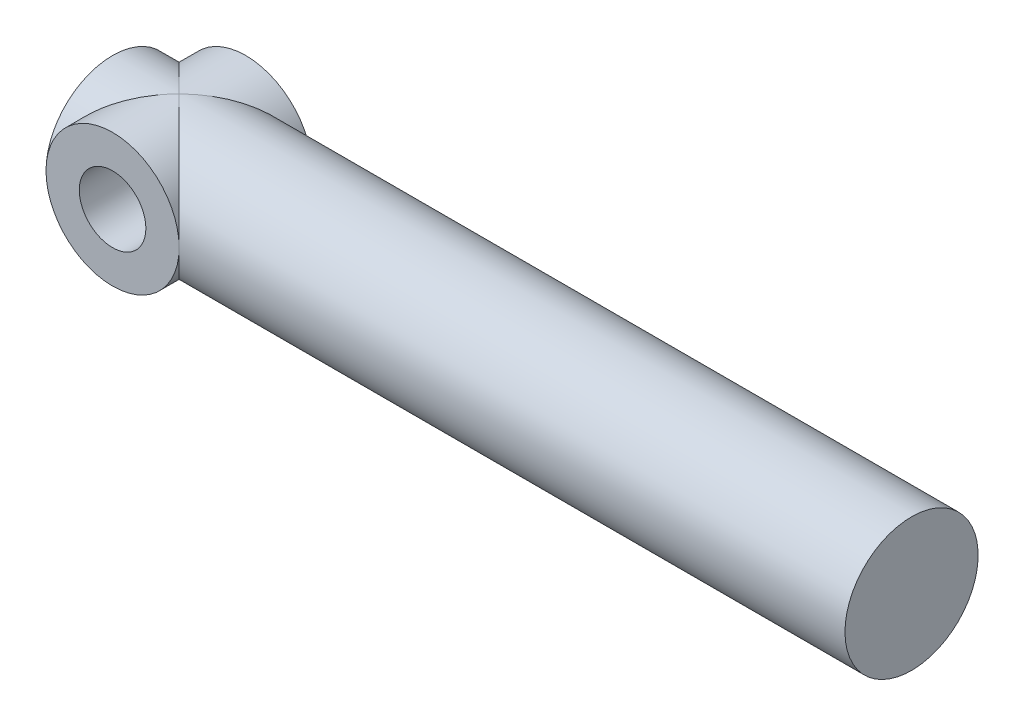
ISO-10303-21;
HEADER;
FILE_DESCRIPTION(('STEP AP214'),'2;1');
FILE_NAME('part.step','',(''),(''),'','','');
FILE_SCHEMA(('AUTOMOTIVE_DESIGN { 1 0 10303 214 1 1 1 1 }'));
ENDSEC;
DATA;
#1=APPLICATION_CONTEXT('core data for automotive mechanical design processes');
#2=APPLICATION_PROTOCOL_DEFINITION('international standard','automotive_design',2000,#1);
#3=PRODUCT_CONTEXT('',#1,'mechanical');
#4=PRODUCT('Part','Part','',(#3));
#5=PRODUCT_RELATED_PRODUCT_CATEGORY('part','',(#4));
#6=PRODUCT_DEFINITION_FORMATION('','',#4);
#7=PRODUCT_DEFINITION_CONTEXT('part definition',#1,'design');
#8=PRODUCT_DEFINITION('design','',#6,#7);
#9=PRODUCT_DEFINITION_SHAPE('','',#8);
#10=(LENGTH_UNIT() NAMED_UNIT(*) SI_UNIT(.MILLI.,.METRE.));
#11=(NAMED_UNIT(*) PLANE_ANGLE_UNIT() SI_UNIT($,.RADIAN.));
#12=(NAMED_UNIT(*) SI_UNIT($,.STERADIAN.) SOLID_ANGLE_UNIT());
#13=UNCERTAINTY_MEASURE_WITH_UNIT(LENGTH_MEASURE(1.E-05),#10,'distance_accuracy_value','');
#14=(GEOMETRIC_REPRESENTATION_CONTEXT(3) GLOBAL_UNCERTAINTY_ASSIGNED_CONTEXT((#13)) GLOBAL_UNIT_ASSIGNED_CONTEXT((#10,
#11,#12)) REPRESENTATION_CONTEXT('',''));
#15=CARTESIAN_POINT('',(0.,0.,0.));
#16=DIRECTION('',(0.,0.,1.));
#17=DIRECTION('',(1.,0.,0.));
#18=AXIS2_PLACEMENT_3D('',#15,#16,#17);
#19=CARTESIAN_POINT('',(0.,0.,0.));
#20=DIRECTION('',(-1.,0.,0.));
#21=DIRECTION('',(0.,0.,1.));
#22=AXIS2_PLACEMENT_3D('',#19,#20,#21);
#23=CYLINDRICAL_SURFACE('',#22,3.175);
#24=CARTESIAN_POINT('',(38.1,0.,0.));
#25=DIRECTION('',(-1.,0.,0.));
#26=DIRECTION('',(0.,0.,1.));
#27=AXIS2_PLACEMENT_3D('',#24,#25,#26);
#28=CIRCLE('',#27,3.175);
#29=CARTESIAN_POINT('',(38.1,0.,3.175));
#30=VERTEX_POINT('',#29);
#31=EDGE_CURVE('E80',#30,#30,#28,.T.);
#32=ORIENTED_EDGE('',*,*,#31,.T.);
#33=EDGE_LOOP('',(#32));
#34=FACE_BOUND('',#33,.T.);
#35=CARTESIAN_POINT('',(3.175,0.,0.));
#36=DIRECTION('',(-0.707106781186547,0.,-0.707106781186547));
#37=DIRECTION('',(-0.707106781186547,0.,0.707106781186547));
#38=AXIS2_PLACEMENT_3D('',#35,#36,#37);
#39=ELLIPSE('',#38,4.49012806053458,3.175);
#40=CARTESIAN_POINT('',(3.175,3.175,0.));
#41=VERTEX_POINT('',#40);
#42=CARTESIAN_POINT('',(6.35,0.,-3.175));
#43=VERTEX_POINT('',#42);
#44=EDGE_CURVE('E76',#41,#43,#39,.T.);
#45=ORIENTED_EDGE('',*,*,#44,.F.);
#46=CARTESIAN_POINT('',(3.175,0.,0.));
#47=DIRECTION('',(-0.707106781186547,0.,0.707106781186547));
#48=DIRECTION('',(-0.707106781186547,0.,-0.707106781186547));
#49=AXIS2_PLACEMENT_3D('',#46,#47,#48);
#50=ELLIPSE('',#49,4.49012806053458,3.175);
#51=CARTESIAN_POINT('',(6.35,0.,3.175));
#52=VERTEX_POINT('',#51);
#53=EDGE_CURVE('E90',#52,#41,#50,.T.);
#54=ORIENTED_EDGE('',*,*,#53,.F.);
#55=CARTESIAN_POINT('',(3.175,-3.175,0.));
#56=VERTEX_POINT('',#55);
#57=EDGE_CURVE('E94',#56,#52,#50,.T.);
#58=ORIENTED_EDGE('',*,*,#57,.F.);
#59=EDGE_CURVE('E53',#43,#56,#39,.T.);
#60=ORIENTED_EDGE('',*,*,#59,.F.);
#61=EDGE_LOOP('',(#45,#54,#58,#60));
#62=FACE_BOUND('',#61,.T.);
#63=ADVANCED_FACE('F30',(#34,#62),#23,.T.);
#64=CARTESIAN_POINT('',(38.1,3.175,0.));
#65=DIRECTION('',(-1.,0.,0.));
#66=DIRECTION('',(0.,0.,1.));
#67=AXIS2_PLACEMENT_3D('',#64,#65,#66);
#68=PLANE('',#67);
#69=ORIENTED_EDGE('',*,*,#31,.F.);
#70=EDGE_LOOP('',(#69));
#71=FACE_BOUND('',#70,.T.);
#72=ADVANCED_FACE('F120',(#71),#68,.F.);
#73=CARTESIAN_POINT('',(3.175,0.,3.17500000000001));
#74=DIRECTION('',(0.,0.,-1.));
#75=DIRECTION('',(-1.,0.,0.));
#76=AXIS2_PLACEMENT_3D('',#73,#74,#75);
#77=CYLINDRICAL_SURFACE('',#76,3.175);
#78=ORIENTED_EDGE('',*,*,#59,.T.);
#79=CARTESIAN_POINT('',(3.175,0.,0.));
#80=DIRECTION('',(-0.707106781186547,0.,0.707106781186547));
#81=DIRECTION('',(-0.707106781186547,0.,-0.707106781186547));
#82=AXIS2_PLACEMENT_3D('',#79,#80,#81);
#83=ELLIPSE('',#82,4.49012806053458,3.175);
#84=CARTESIAN_POINT('',(0.,0.,-3.175));
#85=VERTEX_POINT('',#84);
#86=EDGE_CURVE('E71',#56,#85,#83,.F.);
#87=ORIENTED_EDGE('',*,*,#86,.T.);
#88=CARTESIAN_POINT('',(3.175,0.,-3.17500000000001));
#89=DIRECTION('',(0.,0.,1.));
#90=DIRECTION('',(1.,0.,0.));
#91=AXIS2_PLACEMENT_3D('',#88,#89,#90);
#92=CIRCLE('',#91,3.175);
#93=EDGE_CURVE('E104',#85,#43,#92,.T.);
#94=ORIENTED_EDGE('',*,*,#93,.T.);
#95=EDGE_LOOP('',(#78,#87,#94));
#96=FACE_BOUND('',#95,.T.);
#97=ADVANCED_FACE('F113',(#96),#77,.T.);
#98=EDGE_CURVE('E45',#85,#41,#83,.F.);
#99=ORIENTED_EDGE('',*,*,#98,.T.);
#100=ORIENTED_EDGE('',*,*,#44,.T.);
#101=EDGE_CURVE('E96',#43,#85,#92,.T.);
#102=ORIENTED_EDGE('',*,*,#101,.T.);
#103=EDGE_LOOP('',(#99,#100,#102));
#104=FACE_BOUND('',#103,.T.);
#105=ADVANCED_FACE('F118',(#104),#77,.T.);
#106=CARTESIAN_POINT('',(3.175,0.,-3.17500000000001));
#107=DIRECTION('',(0.,0.,1.));
#108=DIRECTION('',(1.,0.,0.));
#109=AXIS2_PLACEMENT_3D('',#106,#107,#108);
#110=PLANE('',#109);
#111=CARTESIAN_POINT('',(3.175,0.,-3.17500000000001));
#112=DIRECTION('',(0.,0.,1.));
#113=DIRECTION('',(1.,0.,0.));
#114=AXIS2_PLACEMENT_3D('',#111,#112,#113);
#115=CIRCLE('',#114,1.5875);
#116=CARTESIAN_POINT('',(4.7625,0.,-3.17500000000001));
#117=VERTEX_POINT('',#116);
#118=EDGE_CURVE('E102',#117,#117,#115,.T.);
#119=ORIENTED_EDGE('',*,*,#118,.T.);
#120=EDGE_LOOP('',(#119));
#121=FACE_BOUND('',#120,.T.);
#122=ORIENTED_EDGE('',*,*,#101,.F.);
#123=ORIENTED_EDGE('',*,*,#93,.F.);
#124=EDGE_LOOP('',(#122,#123));
#125=FACE_BOUND('',#124,.T.);
#126=ADVANCED_FACE('F116',(#121,#125),#110,.F.);
#127=ORIENTED_EDGE('',*,*,#53,.T.);
#128=CARTESIAN_POINT('',(3.175,0.,0.));
#129=DIRECTION('',(-0.707106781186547,0.,-0.707106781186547));
#130=DIRECTION('',(-0.707106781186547,0.,0.707106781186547));
#131=AXIS2_PLACEMENT_3D('',#128,#129,#130);
#132=ELLIPSE('',#131,4.49012806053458,3.175);
#133=CARTESIAN_POINT('',(0.,0.,3.175));
#134=VERTEX_POINT('',#133);
#135=EDGE_CURVE('E75',#41,#134,#132,.F.);
#136=ORIENTED_EDGE('',*,*,#135,.T.);
#137=CARTESIAN_POINT('',(3.175,0.,3.17500000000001));
#138=DIRECTION('',(0.,0.,1.));
#139=DIRECTION('',(1.,0.,0.));
#140=AXIS2_PLACEMENT_3D('',#137,#138,#139);
#141=CIRCLE('',#140,3.175);
#142=EDGE_CURVE('E89',#52,#134,#141,.T.);
#143=ORIENTED_EDGE('',*,*,#142,.F.);
#144=EDGE_LOOP('',(#127,#136,#143));
#145=FACE_BOUND('',#144,.T.);
#146=ADVANCED_FACE('F87',(#145),#77,.T.);
#147=EDGE_CURVE('E92',#134,#52,#141,.T.);
#148=ORIENTED_EDGE('',*,*,#147,.F.);
#149=EDGE_CURVE('E67',#134,#56,#132,.F.);
#150=ORIENTED_EDGE('',*,*,#149,.T.);
#151=ORIENTED_EDGE('',*,*,#57,.T.);
#152=EDGE_LOOP('',(#148,#150,#151));
#153=FACE_BOUND('',#152,.T.);
#154=ADVANCED_FACE('F93',(#153),#77,.T.);
#155=CARTESIAN_POINT('',(3.175,0.,3.17500000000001));
#156=DIRECTION('',(0.,0.,1.));
#157=DIRECTION('',(1.,0.,0.));
#158=AXIS2_PLACEMENT_3D('',#155,#156,#157);
#159=PLANE('',#158);
#160=CARTESIAN_POINT('',(3.175,0.,3.17500000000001));
#161=DIRECTION('',(0.,0.,1.));
#162=DIRECTION('',(1.,0.,0.));
#163=AXIS2_PLACEMENT_3D('',#160,#161,#162);
#164=CIRCLE('',#163,1.5875);
#165=CARTESIAN_POINT('',(4.7625,0.,3.17500000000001));
#166=VERTEX_POINT('',#165);
#167=EDGE_CURVE('E117',#166,#166,#164,.T.);
#168=ORIENTED_EDGE('',*,*,#167,.F.);
#169=EDGE_LOOP('',(#168));
#170=FACE_BOUND('',#169,.T.);
#171=ORIENTED_EDGE('',*,*,#147,.T.);
#172=ORIENTED_EDGE('',*,*,#142,.T.);
#173=EDGE_LOOP('',(#171,#172));
#174=FACE_BOUND('',#173,.T.);
#175=ADVANCED_FACE('F98',(#170,#174),#159,.T.);
#176=CARTESIAN_POINT('',(0.,0.,0.));
#177=DIRECTION('',(1.,0.,0.));
#178=DIRECTION('',(0.,0.,-1.));
#179=AXIS2_PLACEMENT_3D('',#176,#177,#178);
#180=PLANE('',#179);
#181=CARTESIAN_POINT('',(0.,0.,0.));
#182=DIRECTION('',(-1.,0.,0.));
#183=DIRECTION('',(0.,0.,1.));
#184=AXIS2_PLACEMENT_3D('',#181,#182,#183);
#185=CIRCLE('',#184,3.175);
#186=EDGE_CURVE('E11',#134,#85,#185,.T.);
#187=ORIENTED_EDGE('',*,*,#186,.T.);
#188=EDGE_CURVE('E38',#85,#134,#185,.T.);
#189=ORIENTED_EDGE('',*,*,#188,.T.);
#190=EDGE_LOOP('',(#187,#189));
#191=FACE_BOUND('',#190,.T.);
#192=ADVANCED_FACE('F32',(#191),#180,.F.);
#193=ORIENTED_EDGE('',*,*,#135,.F.);
#194=ORIENTED_EDGE('',*,*,#98,.F.);
#195=ORIENTED_EDGE('',*,*,#186,.F.);
#196=EDGE_LOOP('',(#193,#194,#195));
#197=FACE_BOUND('',#196,.T.);
#198=ADVANCED_FACE('F83',(#197),#23,.T.);
#199=ORIENTED_EDGE('',*,*,#149,.F.);
#200=ORIENTED_EDGE('',*,*,#188,.F.);
#201=ORIENTED_EDGE('',*,*,#86,.F.);
#202=EDGE_LOOP('',(#199,#200,#201));
#203=FACE_BOUND('',#202,.T.);
#204=ADVANCED_FACE('F69',(#203),#23,.T.);
#205=CARTESIAN_POINT('',(3.175,0.,6.35));
#206=DIRECTION('',(0.,0.,-1.));
#207=DIRECTION('',(-1.,0.,0.));
#208=AXIS2_PLACEMENT_3D('',#205,#206,#207);
#209=CYLINDRICAL_SURFACE('',#208,1.5875);
#210=ORIENTED_EDGE('',*,*,#118,.F.);
#211=EDGE_LOOP('',(#210));
#212=FACE_BOUND('',#211,.T.);
#213=ORIENTED_EDGE('',*,*,#167,.T.);
#214=EDGE_LOOP('',(#213));
#215=FACE_BOUND('',#214,.T.);
#216=ADVANCED_FACE('F127',(#212,#215),#209,.F.);
#217=CLOSED_SHELL('',(#63,#72,#97,#105,#126,#146,#154,#175,#192,#198,#204,#216));
#218=MANIFOLD_SOLID_BREP('B2',#217);
#219=ADVANCED_BREP_SHAPE_REPRESENTATION('',(#18,#218),#14);
#220=SHAPE_DEFINITION_REPRESENTATION(#9,#219);
ENDSEC;
END-ISO-10303-21;
